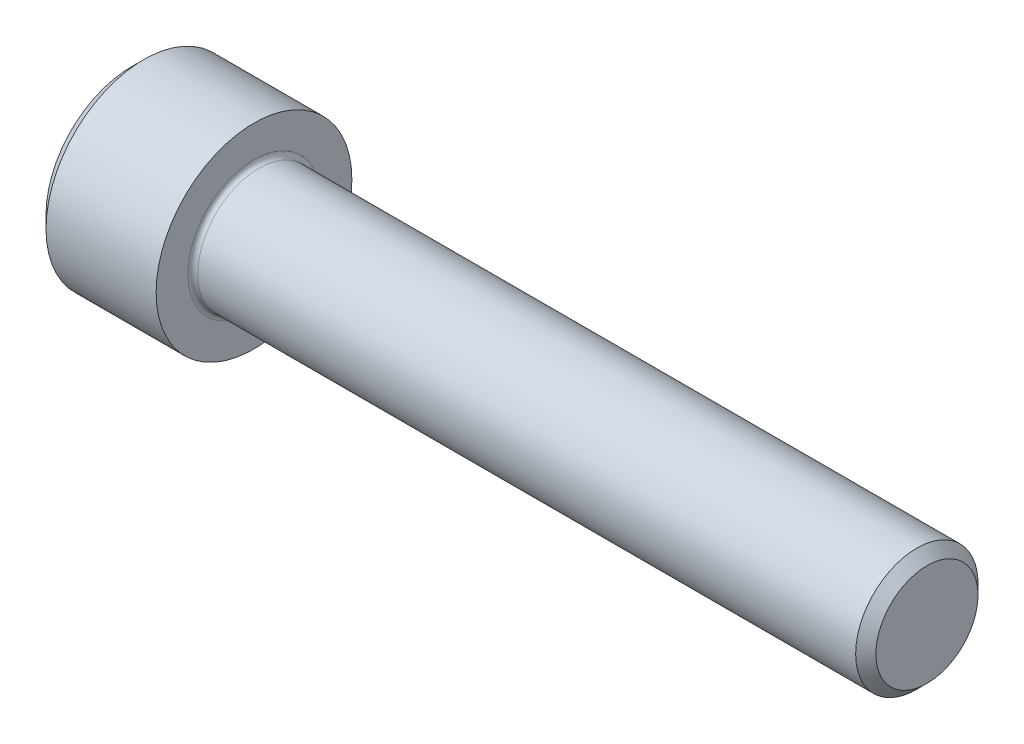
ISO-10303-21;
HEADER;
FILE_DESCRIPTION(('STEP AP214'),'2;1');
FILE_NAME('part.step','',(''),(''),'','','');
FILE_SCHEMA(('AUTOMOTIVE_DESIGN { 1 0 10303 214 1 1 1 1 }'));
ENDSEC;
DATA;
#1=APPLICATION_CONTEXT('core data for automotive mechanical design processes');
#2=APPLICATION_PROTOCOL_DEFINITION('international standard','automotive_design',2000,#1);
#3=PRODUCT_CONTEXT('',#1,'mechanical');
#4=PRODUCT('Part','Part','',(#3));
#5=PRODUCT_RELATED_PRODUCT_CATEGORY('part','',(#4));
#6=PRODUCT_DEFINITION_FORMATION('','',#4);
#7=PRODUCT_DEFINITION_CONTEXT('part definition',#1,'design');
#8=PRODUCT_DEFINITION('design','',#6,#7);
#9=PRODUCT_DEFINITION_SHAPE('','',#8);
#10=(LENGTH_UNIT() NAMED_UNIT(*) SI_UNIT(.MILLI.,.METRE.));
#11=(NAMED_UNIT(*) PLANE_ANGLE_UNIT() SI_UNIT($,.RADIAN.));
#12=(NAMED_UNIT(*) SI_UNIT($,.STERADIAN.) SOLID_ANGLE_UNIT());
#13=UNCERTAINTY_MEASURE_WITH_UNIT(LENGTH_MEASURE(1.E-05),#10,'distance_accuracy_value','');
#14=(GEOMETRIC_REPRESENTATION_CONTEXT(3) GLOBAL_UNCERTAINTY_ASSIGNED_CONTEXT((#13)) GLOBAL_UNIT_ASSIGNED_CONTEXT((#10,
#11,#12)) REPRESENTATION_CONTEXT('',''));
#15=CARTESIAN_POINT('',(0.,0.,0.));
#16=DIRECTION('',(0.,0.,1.));
#17=DIRECTION('',(1.,0.,0.));
#18=AXIS2_PLACEMENT_3D('',#15,#16,#17);
#19=CARTESIAN_POINT('',(0.,0.,0.));
#20=DIRECTION('',(-1.,0.,0.));
#21=DIRECTION('',(0.,0.,1.));
#22=AXIS2_PLACEMENT_3D('',#19,#20,#21);
#23=PLANE('',#22);
#24=DIRECTION('',(0.,-0.499999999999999,0.866025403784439));
#25=VECTOR('',#24,1.);
#26=CARTESIAN_POINT('',(0.,4.68519743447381,0.));
#27=LINE('',#26,#25);
#28=CARTESIAN_POINT('',(0.,4.68519743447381,0.));
#29=VERTEX_POINT('',#28);
#30=CARTESIAN_POINT('',(0.,2.34259871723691,4.05749999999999));
#31=VERTEX_POINT('',#30);
#32=EDGE_CURVE('E255',#29,#31,#27,.T.);
#33=ORIENTED_EDGE('',*,*,#32,.T.);
#34=DIRECTION('',(0.,1.,0.));
#35=VECTOR('',#34,1.);
#36=CARTESIAN_POINT('',(0.,-2.3425987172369,4.0575));
#37=LINE('',#36,#35);
#38=CARTESIAN_POINT('',(0.,-2.3425987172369,4.0575));
#39=VERTEX_POINT('',#38);
#40=EDGE_CURVE('E126',#39,#31,#37,.T.);
#41=ORIENTED_EDGE('',*,*,#40,.F.);
#42=DIRECTION('',(0.,-0.500000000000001,-0.866025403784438));
#43=VECTOR('',#42,1.);
#44=CARTESIAN_POINT('',(0.,-2.3425987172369,4.0575));
#45=LINE('',#44,#43);
#46=CARTESIAN_POINT('',(0.,-4.68519743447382,0.));
#47=VERTEX_POINT('',#46);
#48=EDGE_CURVE('E258',#39,#47,#45,.T.);
#49=ORIENTED_EDGE('',*,*,#48,.T.);
#50=DIRECTION('',(0.,0.499999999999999,-0.866025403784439));
#51=VECTOR('',#50,1.);
#52=CARTESIAN_POINT('',(0.,-4.68519743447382,0.));
#53=LINE('',#52,#51);
#54=CARTESIAN_POINT('',(0.,-2.34259871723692,-4.0575));
#55=VERTEX_POINT('',#54);
#56=EDGE_CURVE('E261',#47,#55,#53,.T.);
#57=ORIENTED_EDGE('',*,*,#56,.T.);
#58=DIRECTION('',(0.,-1.,0.));
#59=VECTOR('',#58,1.);
#60=CARTESIAN_POINT('',(0.,2.3425987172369,-4.05750000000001));
#61=LINE('',#60,#59);
#62=CARTESIAN_POINT('',(0.,2.3425987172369,-4.05750000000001));
#63=VERTEX_POINT('',#62);
#64=EDGE_CURVE('E264',#63,#55,#61,.T.);
#65=ORIENTED_EDGE('',*,*,#64,.F.);
#66=DIRECTION('',(0.,-0.500000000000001,-0.866025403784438));
#67=VECTOR('',#66,1.);
#68=CARTESIAN_POINT('',(0.,4.68519743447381,0.));
#69=LINE('',#68,#67);
#70=EDGE_CURVE('E121',#29,#63,#69,.T.);
#71=ORIENTED_EDGE('',*,*,#70,.F.);
#72=EDGE_LOOP('',(#33,#41,#49,#57,#65,#71));
#73=FACE_BOUND('',#72,.T.);
#74=CARTESIAN_POINT('',(0.,0.,0.));
#75=DIRECTION('',(-1.,0.,0.));
#76=DIRECTION('',(0.,0.,1.));
#77=AXIS2_PLACEMENT_3D('',#74,#75,#76);
#78=CIRCLE('',#77,6.99999999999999);
#79=CARTESIAN_POINT('',(0.,0.,6.99999999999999));
#80=VERTEX_POINT('',#79);
#81=EDGE_CURVE('E150',#80,#80,#78,.T.);
#82=ORIENTED_EDGE('',*,*,#81,.T.);
#83=EDGE_LOOP('',(#82));
#84=FACE_BOUND('',#83,.T.);
#85=ADVANCED_FACE('F30',(#73,#84),#23,.T.);
#86=CARTESIAN_POINT('',(0.,0.,0.));
#87=DIRECTION('',(1.,0.,0.));
#88=DIRECTION('',(0.,0.,-1.));
#89=AXIS2_PLACEMENT_3D('',#86,#87,#88);
#90=CONICAL_SURFACE('',#89,6.99999999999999,0.785398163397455);
#91=CARTESIAN_POINT('',(1.,0.,0.));
#92=DIRECTION('',(-1.,0.,0.));
#93=DIRECTION('',(0.,0.,1.));
#94=AXIS2_PLACEMENT_3D('',#91,#92,#93);
#95=CIRCLE('',#94,8.);
#96=CARTESIAN_POINT('',(1.,0.,8.));
#97=VERTEX_POINT('',#96);
#98=EDGE_CURVE('E147',#97,#97,#95,.T.);
#99=ORIENTED_EDGE('',*,*,#98,.T.);
#100=EDGE_LOOP('',(#99));
#101=FACE_BOUND('',#100,.T.);
#102=ORIENTED_EDGE('',*,*,#81,.F.);
#103=EDGE_LOOP('',(#102));
#104=FACE_BOUND('',#103,.T.);
#105=ADVANCED_FACE('F171',(#101,#104),#90,.T.);
#106=CARTESIAN_POINT('',(-31.75,0.,0.));
#107=DIRECTION('',(-1.,0.,0.));
#108=DIRECTION('',(0.,0.,1.));
#109=AXIS2_PLACEMENT_3D('',#106,#107,#108);
#110=CYLINDRICAL_SURFACE('',#109,8.);
#111=CARTESIAN_POINT('',(10.,0.,0.));
#112=DIRECTION('',(-1.,0.,0.));
#113=DIRECTION('',(0.,0.,1.));
#114=AXIS2_PLACEMENT_3D('',#111,#112,#113);
#115=CIRCLE('',#114,8.);
#116=CARTESIAN_POINT('',(10.,0.,8.));
#117=VERTEX_POINT('',#116);
#118=EDGE_CURVE('E144',#117,#117,#115,.T.);
#119=ORIENTED_EDGE('',*,*,#118,.T.);
#120=EDGE_LOOP('',(#119));
#121=FACE_BOUND('',#120,.T.);
#122=ORIENTED_EDGE('',*,*,#98,.F.);
#123=EDGE_LOOP('',(#122));
#124=FACE_BOUND('',#123,.T.);
#125=ADVANCED_FACE('F176',(#121,#124),#110,.T.);
#126=CARTESIAN_POINT('',(10.,8.,0.));
#127=DIRECTION('',(1.,0.,0.));
#128=DIRECTION('',(0.,0.,-1.));
#129=AXIS2_PLACEMENT_3D('',#126,#127,#128);
#130=PLANE('',#129);
#131=CARTESIAN_POINT('',(10.,0.,0.));
#132=DIRECTION('',(1.,0.,0.));
#133=DIRECTION('',(0.,0.,-1.));
#134=AXIS2_PLACEMENT_3D('',#131,#132,#133);
#135=CIRCLE('',#134,5.4);
#136=CARTESIAN_POINT('',(10.,0.,-5.4));
#137=VERTEX_POINT('',#136);
#138=EDGE_CURVE('E38',#137,#137,#135,.F.);
#139=ORIENTED_EDGE('',*,*,#138,.T.);
#140=EDGE_LOOP('',(#139));
#141=FACE_BOUND('',#140,.T.);
#142=ORIENTED_EDGE('',*,*,#118,.F.);
#143=EDGE_LOOP('',(#142));
#144=FACE_BOUND('',#143,.T.);
#145=ADVANCED_FACE('F155',(#141,#144),#130,.T.);
#146=CARTESIAN_POINT('',(-31.75,0.,0.));
#147=DIRECTION('',(-1.,0.,0.));
#148=DIRECTION('',(0.,0.,1.));
#149=AXIS2_PLACEMENT_3D('',#146,#147,#148);
#150=CYLINDRICAL_SURFACE('',#149,5.);
#151=CARTESIAN_POINT('',(10.4,0.,0.));
#152=DIRECTION('',(1.,0.,0.));
#153=DIRECTION('',(0.,0.,-1.));
#154=AXIS2_PLACEMENT_3D('',#151,#152,#153);
#155=CIRCLE('',#154,5.);
#156=CARTESIAN_POINT('',(10.4,0.,-5.));
#157=VERTEX_POINT('',#156);
#158=EDGE_CURVE('E11',#157,#157,#155,.T.);
#159=ORIENTED_EDGE('',*,*,#158,.T.);
#160=EDGE_LOOP('',(#159));
#161=FACE_BOUND('',#160,.T.);
#162=CARTESIAN_POINT('',(64.172,0.,0.));
#163=DIRECTION('',(-1.,0.,0.));
#164=DIRECTION('',(0.,0.,1.));
#165=AXIS2_PLACEMENT_3D('',#162,#163,#164);
#166=CIRCLE('',#165,5.);
#167=CARTESIAN_POINT('',(64.172,0.,5.));
#168=VERTEX_POINT('',#167);
#169=EDGE_CURVE('E141',#168,#168,#166,.T.);
#170=ORIENTED_EDGE('',*,*,#169,.T.);
#171=EDGE_LOOP('',(#170));
#172=FACE_BOUND('',#171,.T.);
#173=ADVANCED_FACE('F186',(#161,#172),#150,.T.);
#174=CARTESIAN_POINT('',(65.,0.,0.));
#175=DIRECTION('',(-1.,0.,0.));
#176=DIRECTION('',(0.,0.,1.));
#177=AXIS2_PLACEMENT_3D('',#174,#175,#176);
#178=CONICAL_SURFACE('',#177,4.172,0.78539816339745);
#179=ORIENTED_EDGE('',*,*,#169,.F.);
#180=EDGE_LOOP('',(#179));
#181=FACE_BOUND('',#180,.T.);
#182=CARTESIAN_POINT('',(65.,0.,0.));
#183=DIRECTION('',(-1.,0.,0.));
#184=DIRECTION('',(0.,0.,1.));
#185=AXIS2_PLACEMENT_3D('',#182,#183,#184);
#186=CIRCLE('',#185,4.172);
#187=CARTESIAN_POINT('',(65.,0.,4.172));
#188=VERTEX_POINT('',#187);
#189=EDGE_CURVE('E137',#188,#188,#186,.T.);
#190=ORIENTED_EDGE('',*,*,#189,.T.);
#191=EDGE_LOOP('',(#190));
#192=FACE_BOUND('',#191,.T.);
#193=ADVANCED_FACE('F166',(#181,#192),#178,.T.);
#194=CARTESIAN_POINT('',(65.,4.172,0.));
#195=DIRECTION('',(1.,0.,0.));
#196=DIRECTION('',(0.,0.,-1.));
#197=AXIS2_PLACEMENT_3D('',#194,#195,#196);
#198=PLANE('',#197);
#199=ORIENTED_EDGE('',*,*,#189,.F.);
#200=EDGE_LOOP('',(#199));
#201=FACE_BOUND('',#200,.T.);
#202=ADVANCED_FACE('F159',(#201),#198,.T.);
#203=CARTESIAN_POINT('',(10.4,0.,0.));
#204=DIRECTION('',(1.,0.,0.));
#205=DIRECTION('',(0.,0.,-1.));
#206=AXIS2_PLACEMENT_3D('',#203,#204,#205);
#207=TOROIDAL_SURFACE('',#206,5.4,0.4);
#208=ORIENTED_EDGE('',*,*,#158,.F.);
#209=EDGE_LOOP('',(#208));
#210=FACE_BOUND('',#209,.T.);
#211=ORIENTED_EDGE('',*,*,#138,.F.);
#212=EDGE_LOOP('',(#211));
#213=FACE_BOUND('',#212,.T.);
#214=ADVANCED_FACE('F32',(#210,#213),#207,.F.);
#215=CARTESIAN_POINT('',(5.,4.68519743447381,0.));
#216=DIRECTION('',(0.,-0.866025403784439,-0.499999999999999));
#217=DIRECTION('',(0.,0.499999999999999,-0.866025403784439));
#218=AXIS2_PLACEMENT_3D('',#215,#216,#217);
#219=PLANE('',#218);
#220=ORIENTED_EDGE('',*,*,#32,.F.);
#221=DIRECTION('',(-1.,0.,0.));
#222=VECTOR('',#221,1.);
#223=CARTESIAN_POINT('',(5.,4.68519743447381,0.));
#224=LINE('',#223,#222);
#225=CARTESIAN_POINT('',(5.,4.68519743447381,0.));
#226=VERTEX_POINT('',#225);
#227=EDGE_CURVE('E245',#226,#29,#224,.T.);
#228=ORIENTED_EDGE('',*,*,#227,.F.);
#229=DIRECTION('',(0.,-0.499999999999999,0.866025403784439));
#230=VECTOR('',#229,1.);
#231=CARTESIAN_POINT('',(5.,4.68519743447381,0.));
#232=LINE('',#231,#230);
#233=CARTESIAN_POINT('',(5.,3.51389807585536,2.02874999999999));
#234=VERTEX_POINT('',#233);
#235=EDGE_CURVE('E113',#226,#234,#232,.T.);
#236=ORIENTED_EDGE('',*,*,#235,.T.);
#237=CARTESIAN_POINT('',(5.,2.34259871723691,4.05749999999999));
#238=VERTEX_POINT('',#237);
#239=EDGE_CURVE('E104',#234,#238,#232,.T.);
#240=ORIENTED_EDGE('',*,*,#239,.T.);
#241=DIRECTION('',(-1.,0.,0.));
#242=VECTOR('',#241,1.);
#243=CARTESIAN_POINT('',(5.,2.34259871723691,4.05749999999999));
#244=LINE('',#243,#242);
#245=EDGE_CURVE('E118',#238,#31,#244,.T.);
#246=ORIENTED_EDGE('',*,*,#245,.T.);
#247=EDGE_LOOP('',(#220,#228,#236,#240,#246));
#248=FACE_BOUND('',#247,.T.);
#249=ADVANCED_FACE('F117',(#248),#219,.T.);
#250=CARTESIAN_POINT('',(5.,-2.3425987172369,4.0575));
#251=DIRECTION('',(0.,0.,1.));
#252=DIRECTION('',(0.,-1.,0.));
#253=AXIS2_PLACEMENT_3D('',#250,#251,#252);
#254=PLANE('',#253);
#255=ORIENTED_EDGE('',*,*,#40,.T.);
#256=ORIENTED_EDGE('',*,*,#245,.F.);
#257=DIRECTION('',(0.,1.,0.));
#258=VECTOR('',#257,1.);
#259=CARTESIAN_POINT('',(5.,-2.3425987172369,4.0575));
#260=LINE('',#259,#258);
#261=CARTESIAN_POINT('',(5.,0.,4.0575));
#262=VERTEX_POINT('',#261);
#263=EDGE_CURVE('E101',#262,#238,#260,.T.);
#264=ORIENTED_EDGE('',*,*,#263,.F.);
#265=CARTESIAN_POINT('',(5.,-2.3425987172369,4.0575));
#266=VERTEX_POINT('',#265);
#267=EDGE_CURVE('E112',#266,#262,#260,.T.);
#268=ORIENTED_EDGE('',*,*,#267,.F.);
#269=DIRECTION('',(-1.,0.,0.));
#270=VECTOR('',#269,1.);
#271=CARTESIAN_POINT('',(5.,-2.3425987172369,4.0575));
#272=LINE('',#271,#270);
#273=EDGE_CURVE('E128',#266,#39,#272,.T.);
#274=ORIENTED_EDGE('',*,*,#273,.T.);
#275=EDGE_LOOP('',(#255,#256,#264,#268,#274));
#276=FACE_BOUND('',#275,.T.);
#277=ADVANCED_FACE('F123',(#276),#254,.F.);
#278=CARTESIAN_POINT('',(5.,-2.3425987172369,4.0575));
#279=DIRECTION('',(0.,0.866025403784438,-0.500000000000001));
#280=DIRECTION('',(0.,0.500000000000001,0.866025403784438));
#281=AXIS2_PLACEMENT_3D('',#278,#279,#280);
#282=PLANE('',#281);
#283=ORIENTED_EDGE('',*,*,#48,.F.);
#284=ORIENTED_EDGE('',*,*,#273,.F.);
#285=DIRECTION('',(0.,-0.500000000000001,-0.866025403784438));
#286=VECTOR('',#285,1.);
#287=CARTESIAN_POINT('',(5.,-2.3425987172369,4.0575));
#288=LINE('',#287,#286);
#289=CARTESIAN_POINT('',(5.,-3.51389807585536,2.02875));
#290=VERTEX_POINT('',#289);
#291=EDGE_CURVE('E284',#266,#290,#288,.T.);
#292=ORIENTED_EDGE('',*,*,#291,.T.);
#293=CARTESIAN_POINT('',(5.,-4.68519743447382,0.));
#294=VERTEX_POINT('',#293);
#295=EDGE_CURVE('E273',#290,#294,#288,.T.);
#296=ORIENTED_EDGE('',*,*,#295,.T.);
#297=DIRECTION('',(-1.,0.,0.));
#298=VECTOR('',#297,1.);
#299=CARTESIAN_POINT('',(5.,-4.68519743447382,0.));
#300=LINE('',#299,#298);
#301=EDGE_CURVE('E133',#294,#47,#300,.T.);
#302=ORIENTED_EDGE('',*,*,#301,.T.);
#303=EDGE_LOOP('',(#283,#284,#292,#296,#302));
#304=FACE_BOUND('',#303,.T.);
#305=ADVANCED_FACE('F199',(#304),#282,.T.);
#306=CARTESIAN_POINT('',(5.,-4.68519743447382,0.));
#307=DIRECTION('',(0.,0.866025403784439,0.499999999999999));
#308=DIRECTION('',(0.,-0.499999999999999,0.866025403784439));
#309=AXIS2_PLACEMENT_3D('',#306,#307,#308);
#310=PLANE('',#309);
#311=ORIENTED_EDGE('',*,*,#56,.F.);
#312=ORIENTED_EDGE('',*,*,#301,.F.);
#313=DIRECTION('',(0.,0.499999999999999,-0.866025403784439));
#314=VECTOR('',#313,1.);
#315=CARTESIAN_POINT('',(5.,-4.68519743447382,0.));
#316=LINE('',#315,#314);
#317=CARTESIAN_POINT('',(5.,-3.51389807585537,-2.02875));
#318=VERTEX_POINT('',#317);
#319=EDGE_CURVE('E251',#294,#318,#316,.T.);
#320=ORIENTED_EDGE('',*,*,#319,.T.);
#321=CARTESIAN_POINT('',(5.,-2.34259871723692,-4.0575));
#322=VERTEX_POINT('',#321);
#323=EDGE_CURVE('E283',#318,#322,#316,.T.);
#324=ORIENTED_EDGE('',*,*,#323,.T.);
#325=DIRECTION('',(-1.,0.,0.));
#326=VECTOR('',#325,1.);
#327=CARTESIAN_POINT('',(5.,-2.34259871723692,-4.0575));
#328=LINE('',#327,#326);
#329=EDGE_CURVE('E244',#322,#55,#328,.T.);
#330=ORIENTED_EDGE('',*,*,#329,.T.);
#331=EDGE_LOOP('',(#311,#312,#320,#324,#330));
#332=FACE_BOUND('',#331,.T.);
#333=ADVANCED_FACE('F202',(#332),#310,.T.);
#334=CARTESIAN_POINT('',(5.,2.3425987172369,-4.05750000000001));
#335=DIRECTION('',(0.,0.,-1.));
#336=DIRECTION('',(0.,1.,0.));
#337=AXIS2_PLACEMENT_3D('',#334,#335,#336);
#338=PLANE('',#337);
#339=ORIENTED_EDGE('',*,*,#64,.T.);
#340=ORIENTED_EDGE('',*,*,#329,.F.);
#341=DIRECTION('',(0.,-1.,0.));
#342=VECTOR('',#341,1.);
#343=CARTESIAN_POINT('',(5.,2.3425987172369,-4.05750000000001));
#344=LINE('',#343,#342);
#345=CARTESIAN_POINT('',(5.,0.,-4.0575));
#346=VERTEX_POINT('',#345);
#347=EDGE_CURVE('E248',#346,#322,#344,.T.);
#348=ORIENTED_EDGE('',*,*,#347,.F.);
#349=CARTESIAN_POINT('',(5.,2.3425987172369,-4.05750000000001));
#350=VERTEX_POINT('',#349);
#351=EDGE_CURVE('E45',#350,#346,#344,.T.);
#352=ORIENTED_EDGE('',*,*,#351,.F.);
#353=DIRECTION('',(-1.,0.,0.));
#354=VECTOR('',#353,1.);
#355=CARTESIAN_POINT('',(5.,2.3425987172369,-4.05750000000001));
#356=LINE('',#355,#354);
#357=EDGE_CURVE('E241',#350,#63,#356,.T.);
#358=ORIENTED_EDGE('',*,*,#357,.T.);
#359=EDGE_LOOP('',(#339,#340,#348,#352,#358));
#360=FACE_BOUND('',#359,.T.);
#361=ADVANCED_FACE('F206',(#360),#338,.F.);
#362=CARTESIAN_POINT('',(5.,4.68519743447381,0.));
#363=DIRECTION('',(0.,0.866025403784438,-0.500000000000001));
#364=DIRECTION('',(0.,0.500000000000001,0.866025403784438));
#365=AXIS2_PLACEMENT_3D('',#362,#363,#364);
#366=PLANE('',#365);
#367=ORIENTED_EDGE('',*,*,#70,.T.);
#368=ORIENTED_EDGE('',*,*,#357,.F.);
#369=DIRECTION('',(0.,-0.500000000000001,-0.866025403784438));
#370=VECTOR('',#369,1.);
#371=CARTESIAN_POINT('',(5.,4.68519743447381,0.));
#372=LINE('',#371,#370);
#373=CARTESIAN_POINT('',(5.,3.51389807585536,-2.02875));
#374=VERTEX_POINT('',#373);
#375=EDGE_CURVE('E231',#374,#350,#372,.T.);
#376=ORIENTED_EDGE('',*,*,#375,.F.);
#377=EDGE_CURVE('E237',#226,#374,#372,.T.);
#378=ORIENTED_EDGE('',*,*,#377,.F.);
#379=ORIENTED_EDGE('',*,*,#227,.T.);
#380=EDGE_LOOP('',(#367,#368,#376,#378,#379));
#381=FACE_BOUND('',#380,.T.);
#382=ADVANCED_FACE('F210',(#381),#366,.F.);
#383=CARTESIAN_POINT('',(5.,7.02779615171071,-4.05750000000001));
#384=DIRECTION('',(1.,0.,0.));
#385=DIRECTION('',(0.,0.,-1.));
#386=AXIS2_PLACEMENT_3D('',#383,#384,#385);
#387=PLANE('',#386);
#388=ORIENTED_EDGE('',*,*,#347,.T.);
#389=ORIENTED_EDGE('',*,*,#323,.F.);
#390=CARTESIAN_POINT('',(5.,0.,0.));
#391=DIRECTION('',(-1.,0.,0.));
#392=DIRECTION('',(0.,0.,1.));
#393=AXIS2_PLACEMENT_3D('',#390,#391,#392);
#394=CIRCLE('',#393,4.0575);
#395=EDGE_CURVE('E279',#346,#318,#394,.T.);
#396=ORIENTED_EDGE('',*,*,#395,.F.);
#397=EDGE_LOOP('',(#388,#389,#396));
#398=FACE_BOUND('',#397,.T.);
#399=ADVANCED_FACE('F214',(#398),#387,.F.);
#400=ORIENTED_EDGE('',*,*,#319,.F.);
#401=ORIENTED_EDGE('',*,*,#295,.F.);
#402=EDGE_CURVE('E131',#318,#290,#394,.T.);
#403=ORIENTED_EDGE('',*,*,#402,.F.);
#404=EDGE_LOOP('',(#400,#401,#403));
#405=FACE_BOUND('',#404,.T.);
#406=ADVANCED_FACE('F217',(#405),#387,.F.);
#407=ORIENTED_EDGE('',*,*,#291,.F.);
#408=ORIENTED_EDGE('',*,*,#267,.T.);
#409=EDGE_CURVE('E127',#290,#262,#394,.T.);
#410=ORIENTED_EDGE('',*,*,#409,.F.);
#411=EDGE_LOOP('',(#407,#408,#410));
#412=FACE_BOUND('',#411,.T.);
#413=ADVANCED_FACE('F222',(#412),#387,.F.);
#414=ORIENTED_EDGE('',*,*,#263,.T.);
#415=ORIENTED_EDGE('',*,*,#239,.F.);
#416=EDGE_CURVE('E107',#262,#234,#394,.T.);
#417=ORIENTED_EDGE('',*,*,#416,.F.);
#418=EDGE_LOOP('',(#414,#415,#417));
#419=FACE_BOUND('',#418,.T.);
#420=ADVANCED_FACE('F103',(#419),#387,.F.);
#421=ORIENTED_EDGE('',*,*,#235,.F.);
#422=ORIENTED_EDGE('',*,*,#377,.T.);
#423=EDGE_CURVE('E138',#234,#374,#394,.T.);
#424=ORIENTED_EDGE('',*,*,#423,.F.);
#425=EDGE_LOOP('',(#421,#422,#424));
#426=FACE_BOUND('',#425,.T.);
#427=ADVANCED_FACE('F225',(#426),#387,.F.);
#428=ORIENTED_EDGE('',*,*,#375,.T.);
#429=ORIENTED_EDGE('',*,*,#351,.T.);
#430=EDGE_CURVE('E234',#374,#346,#394,.T.);
#431=ORIENTED_EDGE('',*,*,#430,.F.);
#432=EDGE_LOOP('',(#428,#429,#431));
#433=FACE_BOUND('',#432,.T.);
#434=ADVANCED_FACE('F195',(#433),#387,.F.);
#435=CARTESIAN_POINT('',(5.,0.,0.));
#436=DIRECTION('',(-1.,0.,0.));
#437=DIRECTION('',(0.,0.,1.));
#438=AXIS2_PLACEMENT_3D('',#435,#436,#437);
#439=CONICAL_SURFACE('',#438,4.0575,1.04719755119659);
#440=CARTESIAN_POINT('',(7.34259871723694,0.,0.));
#441=VERTEX_POINT('',#440);
#442=VERTEX_LOOP('',#441);
#443=FACE_BOUND('',#442,.T.);
#444=ORIENTED_EDGE('',*,*,#416,.T.);
#445=ORIENTED_EDGE('',*,*,#423,.T.);
#446=ORIENTED_EDGE('',*,*,#430,.T.);
#447=ORIENTED_EDGE('',*,*,#395,.T.);
#448=ORIENTED_EDGE('',*,*,#402,.T.);
#449=ORIENTED_EDGE('',*,*,#409,.T.);
#450=EDGE_LOOP('',(#444,#445,#446,#447,#448,#449));
#451=FACE_BOUND('',#450,.T.);
#452=ADVANCED_FACE('F193',(#443,#451),#439,.F.);
#453=CLOSED_SHELL('',(#85,#105,#125,#145,#173,#193,#202,#214,#249,#277,#305,#333,#361,#382,#399,
#406,#413,#420,#427,#434,#452));
#454=MANIFOLD_SOLID_BREP('B2',#453);
#455=ADVANCED_BREP_SHAPE_REPRESENTATION('',(#18,#454),#14);
#456=SHAPE_DEFINITION_REPRESENTATION(#9,#455);
ENDSEC;
END-ISO-10303-21;
